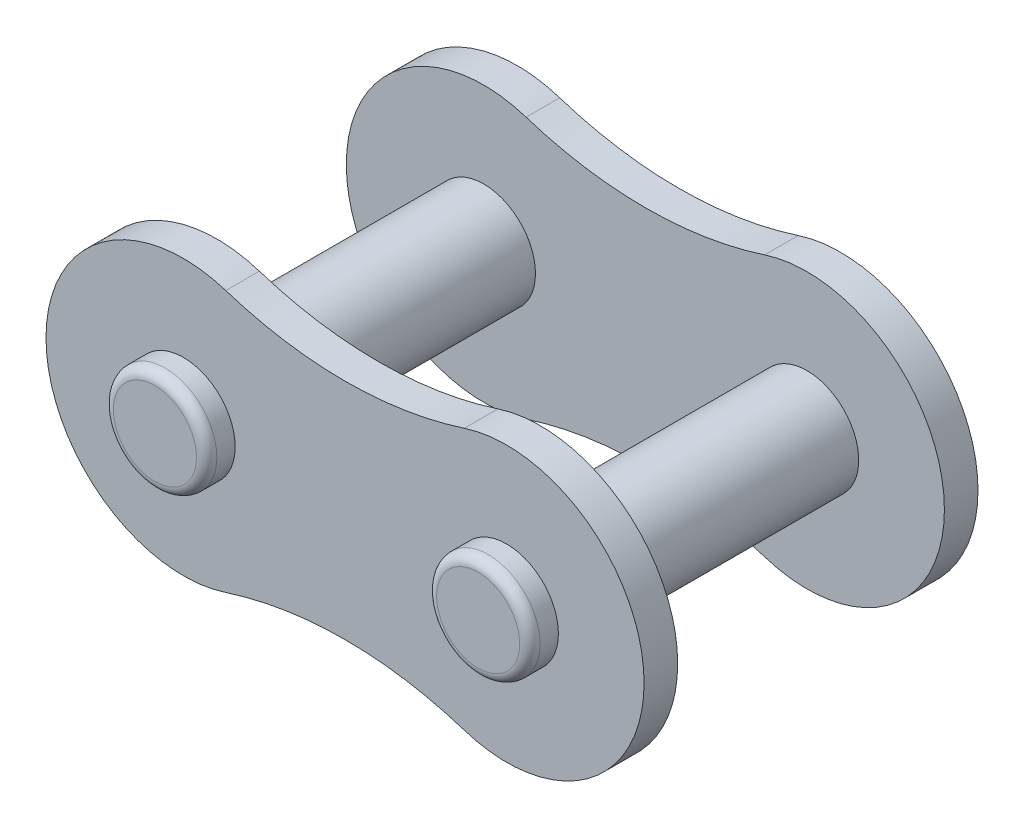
from build123d import *

# Parameters (mm, degrees)
SKETCH3_R           = 2.54
BOSS_EXTRUDE1_DEPTH = 1.65


with BuildPart() as part:
    # Sketch1 → Revolve1 (revolve)
    with BuildSketch(Plane(origin=(0, 0, 0), x_dir=(1, 0, 0), z_dir=(0, 1, 0)), mode=Mode.PRIVATE) as revolve1_sk:
        with BuildLine():
            Line((0, -9.6), (0, 9.6))
            Line((0, 9.6), (2.04, 9.6))
            ThreePointArc((2.04, 9.6), (2.393553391, 9.453553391), (2.54, 9.1))
            Line((2.54, 9.1), (2.54, -9.1))
            ThreePointArc((2.54, -9.1), (2.393553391, -9.453553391), (2.04, -9.6))
            Line((2.04, -9.6), (0, -9.6))
        make_face()
    revolve(revolve1_sk.sketch.rotate(Axis((0, 0, -10.56), (0, 0, 1)), 180), axis=Axis((0, 0, -10.56), (0, 0, 1)))



with BuildPart() as body_2:
    # Sketch2 → Revolve2 (revolve)
    with BuildSketch(Plane.XZ, mode=Mode.PRIVATE) as revolve2_sk:
        with BuildLine():
            Line((-15.875, 9.6), (-17.915, 9.6))
            ThreePointArc((-17.915, 9.6), (-18.268553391, 9.453553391), (-18.415, 9.1))
            Line((-18.415, 9.1), (-18.415, -9.1))
            ThreePointArc((-18.415, -9.1), (-18.268553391, -9.453553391), (-17.915, -9.6))
            Line((-17.915, -9.6), (-15.875, -9.6))
            Line((-15.875, -9.6), (-15.875, 9.6))
        make_face()
    revolve(revolve2_sk.sketch.rotate(Axis((-15.875, 0, 9.6), (0, 0, -1)), 180), axis=Axis((-15.875, 0, 9.6), (0, 0, -1)))


with BuildPart() as part_1:
    add(part.part)

    add(body_2.part)  # Boss-Extrude1 merges body 2
    # Sketch3 → Boss-Extrude1 (add)
    with BuildSketch(Plane(origin=(0, 0, -6.55), x_dir=(0, -1, 0), z_dir=(0, 0, -1))):
        with BuildLine():
            ThreePointArc((-6.421306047, 2.080703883), (0, -6.75), (6.421306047, 2.080703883))
            ThreePointArc((6.421306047, 2.080703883), (5.496093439, 7.9375), (6.421306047, 13.794296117))
            ThreePointArc((6.421306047, 13.794296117), (0, 22.625), (-6.421306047, 13.794296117))
            ThreePointArc((-6.421306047, 13.794296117), (-5.496093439, 7.9375), (-6.421306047, 2.080703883))
        make_face()
        with Locations(Location((0, 0, 0), (0, 0, 90))):
            Circle(SKETCH3_R, mode=Mode.SUBTRACT)
        with Locations(Location((0, 15.875, 0), (0, 0, 270))):
            Circle(SKETCH3_R, mode=Mode.SUBTRACT)
    boss_extrude1 = extrude(amount=BOSS_EXTRUDE1_DEPTH)

    # Mirror1: Boss-Extrude1 across plane
    add(boss_extrude1.mirror(Plane.XY))


solid = part_1.part
